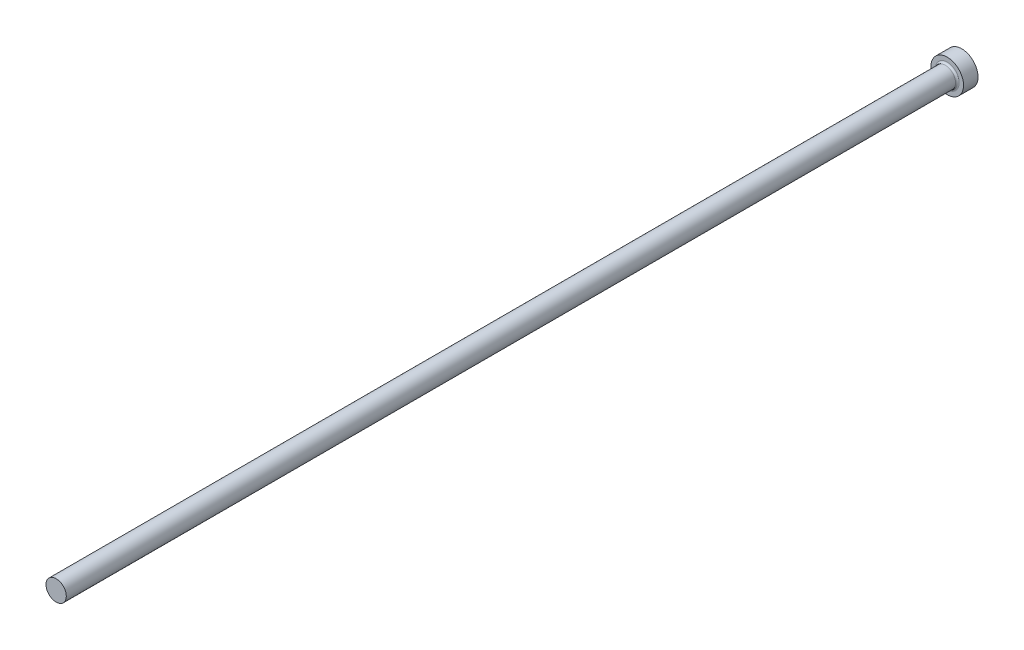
ISO-10303-21;
HEADER;
FILE_DESCRIPTION(('STEP AP214'),'2;1');
FILE_NAME('part.step','',(''),(''),'','','');
FILE_SCHEMA(('AUTOMOTIVE_DESIGN { 1 0 10303 214 1 1 1 1 }'));
ENDSEC;
DATA;
#1=APPLICATION_CONTEXT('core data for automotive mechanical design processes');
#2=APPLICATION_PROTOCOL_DEFINITION('international standard','automotive_design',2000,#1);
#3=PRODUCT_CONTEXT('',#1,'mechanical');
#4=PRODUCT('Part','Part','',(#3));
#5=PRODUCT_RELATED_PRODUCT_CATEGORY('part','',(#4));
#6=PRODUCT_DEFINITION_FORMATION('','',#4);
#7=PRODUCT_DEFINITION_CONTEXT('part definition',#1,'design');
#8=PRODUCT_DEFINITION('design','',#6,#7);
#9=PRODUCT_DEFINITION_SHAPE('','',#8);
#10=(LENGTH_UNIT() NAMED_UNIT(*) SI_UNIT(.MILLI.,.METRE.));
#11=(NAMED_UNIT(*) PLANE_ANGLE_UNIT() SI_UNIT($,.RADIAN.));
#12=(NAMED_UNIT(*) SI_UNIT($,.STERADIAN.) SOLID_ANGLE_UNIT());
#13=UNCERTAINTY_MEASURE_WITH_UNIT(LENGTH_MEASURE(1.E-05),#10,'distance_accuracy_value','');
#14=(GEOMETRIC_REPRESENTATION_CONTEXT(3) GLOBAL_UNCERTAINTY_ASSIGNED_CONTEXT((#13)) GLOBAL_UNIT_ASSIGNED_CONTEXT((#10,
#11,#12)) REPRESENTATION_CONTEXT('',''));
#15=CARTESIAN_POINT('',(0.,0.,0.));
#16=DIRECTION('',(0.,0.,1.));
#17=DIRECTION('',(1.,0.,0.));
#18=AXIS2_PLACEMENT_3D('',#15,#16,#17);
#19=CARTESIAN_POINT('',(4.5,0.,4.));
#20=DIRECTION('',(0.,0.,-1.));
#21=DIRECTION('',(-1.,0.,0.));
#22=AXIS2_PLACEMENT_3D('',#19,#20,#21);
#23=PLANE('',#22);
#24=CARTESIAN_POINT('',(0.,0.,4.));
#25=DIRECTION('',(0.,0.,-1.));
#26=DIRECTION('',(-1.,0.,0.));
#27=AXIS2_PLACEMENT_3D('',#24,#25,#26);
#28=CIRCLE('',#27,3.30000000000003);
#29=CARTESIAN_POINT('',(-3.30000000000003,0.,4.));
#30=VERTEX_POINT('',#29);
#31=EDGE_CURVE('E40',#30,#30,#28,.T.);
#32=ORIENTED_EDGE('',*,*,#31,.T.);
#33=EDGE_LOOP('',(#32));
#34=FACE_BOUND('',#33,.T.);
#35=CARTESIAN_POINT('',(0.,0.,4.));
#36=DIRECTION('',(0.,0.,-1.));
#37=DIRECTION('',(-1.,0.,0.));
#38=AXIS2_PLACEMENT_3D('',#35,#36,#37);
#39=CIRCLE('',#38,4.5);
#40=CARTESIAN_POINT('',(-4.5,0.,4.));
#41=VERTEX_POINT('',#40);
#42=EDGE_CURVE('E44',#41,#41,#39,.T.);
#43=ORIENTED_EDGE('',*,*,#42,.F.);
#44=EDGE_LOOP('',(#43));
#45=FACE_BOUND('',#44,.T.);
#46=ADVANCED_FACE('F33',(#34,#45),#23,.F.);
#47=CARTESIAN_POINT('',(0.,0.,-9.03322817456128));
#48=DIRECTION('',(0.,0.,-1.));
#49=DIRECTION('',(-1.,0.,0.));
#50=AXIS2_PLACEMENT_3D('',#47,#48,#49);
#51=CYLINDRICAL_SURFACE('',#50,4.5);
#52=CARTESIAN_POINT('',(0.,0.,0.));
#53=DIRECTION('',(0.,0.,-1.));
#54=DIRECTION('',(-1.,0.,0.));
#55=AXIS2_PLACEMENT_3D('',#52,#53,#54);
#56=CIRCLE('',#55,4.5);
#57=CARTESIAN_POINT('',(-4.5,0.,0.));
#58=VERTEX_POINT('',#57);
#59=EDGE_CURVE('E48',#58,#58,#56,.T.);
#60=ORIENTED_EDGE('',*,*,#59,.F.);
#61=EDGE_LOOP('',(#60));
#62=FACE_BOUND('',#61,.T.);
#63=ORIENTED_EDGE('',*,*,#42,.T.);
#64=EDGE_LOOP('',(#63));
#65=FACE_BOUND('',#64,.T.);
#66=ADVANCED_FACE('F68',(#62,#65),#51,.T.);
#67=CARTESIAN_POINT('',(0.,0.,0.));
#68=DIRECTION('',(0.,0.,1.));
#69=DIRECTION('',(1.,0.,0.));
#70=AXIS2_PLACEMENT_3D('',#67,#68,#69);
#71=PLANE('',#70);
#72=ORIENTED_EDGE('',*,*,#59,.T.);
#73=EDGE_LOOP('',(#72));
#74=FACE_BOUND('',#73,.T.);
#75=ADVANCED_FACE('F61',(#74),#71,.F.);
#76=CARTESIAN_POINT('',(0.,0.,250.));
#77=DIRECTION('',(0.,0.,-1.));
#78=DIRECTION('',(-1.,0.,0.));
#79=AXIS2_PLACEMENT_3D('',#76,#77,#78);
#80=PLANE('',#79);
#81=CARTESIAN_POINT('',(0.,0.,250.));
#82=DIRECTION('',(0.,0.,-1.));
#83=DIRECTION('',(-1.,0.,0.));
#84=AXIS2_PLACEMENT_3D('',#81,#82,#83);
#85=CIRCLE('',#84,2.80000000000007);
#86=CARTESIAN_POINT('',(-2.80000000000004,0.,250.));
#87=VERTEX_POINT('',#86);
#88=EDGE_CURVE('E53',#87,#87,#85,.T.);
#89=ORIENTED_EDGE('',*,*,#88,.F.);
#90=EDGE_LOOP('',(#89));
#91=FACE_BOUND('',#90,.T.);
#92=ADVANCED_FACE('F59',(#91),#80,.F.);
#93=CARTESIAN_POINT('',(0.,0.,-9.03322817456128));
#94=DIRECTION('',(0.,0.,-1.));
#95=DIRECTION('',(-1.,0.,0.));
#96=AXIS2_PLACEMENT_3D('',#93,#94,#95);
#97=CYLINDRICAL_SURFACE('',#96,2.80000000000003);
#98=CARTESIAN_POINT('',(0.,0.,4.5));
#99=DIRECTION('',(0.,0.,-1.));
#100=DIRECTION('',(-1.,0.,0.));
#101=AXIS2_PLACEMENT_3D('',#98,#99,#100);
#102=CIRCLE('',#101,2.80000000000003);
#103=CARTESIAN_POINT('',(-2.80000000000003,0.,4.5));
#104=VERTEX_POINT('',#103);
#105=EDGE_CURVE('E10',#104,#104,#102,.F.);
#106=ORIENTED_EDGE('',*,*,#105,.T.);
#107=EDGE_LOOP('',(#106));
#108=FACE_BOUND('',#107,.T.);
#109=ORIENTED_EDGE('',*,*,#88,.T.);
#110=EDGE_LOOP('',(#109));
#111=FACE_BOUND('',#110,.T.);
#112=ADVANCED_FACE('F57',(#108,#111),#97,.T.);
#113=CARTESIAN_POINT('',(0.,0.,4.5));
#114=DIRECTION('',(0.,0.,-1.));
#115=DIRECTION('',(-1.,0.,0.));
#116=AXIS2_PLACEMENT_3D('',#113,#114,#115);
#117=TOROIDAL_SURFACE('',#116,3.30000000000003,0.5);
#118=ORIENTED_EDGE('',*,*,#105,.F.);
#119=EDGE_LOOP('',(#118));
#120=FACE_BOUND('',#119,.T.);
#121=ORIENTED_EDGE('',*,*,#31,.F.);
#122=EDGE_LOOP('',(#121));
#123=FACE_BOUND('',#122,.T.);
#124=ADVANCED_FACE('F35',(#120,#123),#117,.F.);
#125=CLOSED_SHELL('',(#46,#66,#75,#92,#112,#124));
#126=MANIFOLD_SOLID_BREP('B2',#125);
#127=ADVANCED_BREP_SHAPE_REPRESENTATION('',(#18,#126),#14);
#128=SHAPE_DEFINITION_REPRESENTATION(#9,#127);
ENDSEC;
END-ISO-10303-21;
